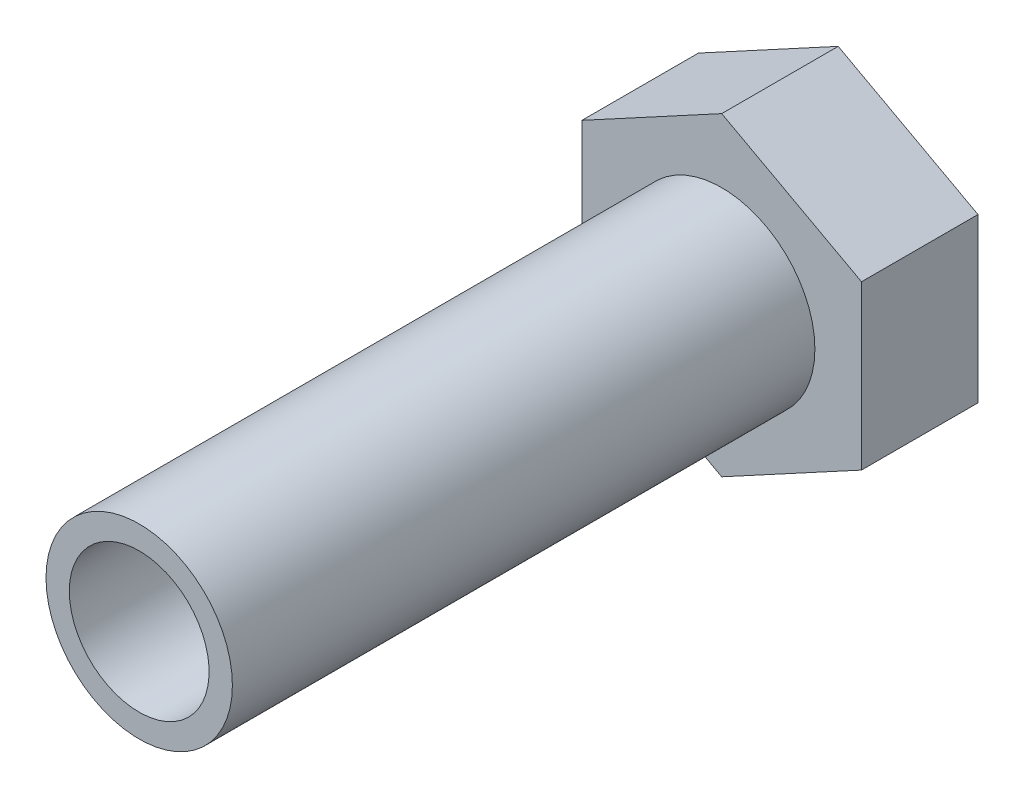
ISO-10303-21;
HEADER;
FILE_DESCRIPTION(('STEP AP214'),'2;1');
FILE_NAME('part.step','',(''),(''),'','','');
FILE_SCHEMA(('AUTOMOTIVE_DESIGN { 1 0 10303 214 1 1 1 1 }'));
ENDSEC;
DATA;
#1=APPLICATION_CONTEXT('core data for automotive mechanical design processes');
#2=APPLICATION_PROTOCOL_DEFINITION('international standard','automotive_design',2000,#1);
#3=PRODUCT_CONTEXT('',#1,'mechanical');
#4=PRODUCT('Part','Part','',(#3));
#5=PRODUCT_RELATED_PRODUCT_CATEGORY('part','',(#4));
#6=PRODUCT_DEFINITION_FORMATION('','',#4);
#7=PRODUCT_DEFINITION_CONTEXT('part definition',#1,'design');
#8=PRODUCT_DEFINITION('design','',#6,#7);
#9=PRODUCT_DEFINITION_SHAPE('','',#8);
#10=(LENGTH_UNIT() NAMED_UNIT(*) SI_UNIT(.MILLI.,.METRE.));
#11=(NAMED_UNIT(*) PLANE_ANGLE_UNIT() SI_UNIT($,.RADIAN.));
#12=(NAMED_UNIT(*) SI_UNIT($,.STERADIAN.) SOLID_ANGLE_UNIT());
#13=UNCERTAINTY_MEASURE_WITH_UNIT(LENGTH_MEASURE(1.E-05),#10,'distance_accuracy_value','');
#14=(GEOMETRIC_REPRESENTATION_CONTEXT(3) GLOBAL_UNCERTAINTY_ASSIGNED_CONTEXT((#13)) GLOBAL_UNIT_ASSIGNED_CONTEXT((#10,
#11,#12)) REPRESENTATION_CONTEXT('',''));
#15=CARTESIAN_POINT('',(0.,0.,0.));
#16=DIRECTION('',(0.,0.,1.));
#17=DIRECTION('',(1.,0.,0.));
#18=AXIS2_PLACEMENT_3D('',#15,#16,#17);
#19=CARTESIAN_POINT('',(-45.9682666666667,27.7426666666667,10.));
#20=DIRECTION('',(0.,0.,-1.));
#21=DIRECTION('',(-1.,0.,0.));
#22=AXIS2_PLACEMENT_3D('',#19,#20,#21);
#23=PLANE('',#22);
#24=DIRECTION('',(-0.879291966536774,0.476283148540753,0.));
#25=VECTOR('',#24,1.);
#26=CARTESIAN_POINT('',(-21.9682666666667,14.7426666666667,10.));
#27=LINE('',#26,#25);
#28=CARTESIAN_POINT('',(-21.9682666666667,14.7426666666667,10.));
#29=VERTEX_POINT('',#28);
#30=CARTESIAN_POINT('',(-33.9682666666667,21.2426666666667,10.));
#31=VERTEX_POINT('',#30);
#32=EDGE_CURVE('E128',#29,#31,#27,.T.);
#33=ORIENTED_EDGE('',*,*,#32,.T.);
#34=DIRECTION('',(-0.879291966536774,-0.476283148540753,0.));
#35=VECTOR('',#34,1.);
#36=CARTESIAN_POINT('',(-45.9682666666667,14.7426666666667,10.));
#37=LINE('',#36,#35);
#38=CARTESIAN_POINT('',(-45.9682666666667,14.7426666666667,10.));
#39=VERTEX_POINT('',#38);
#40=EDGE_CURVE('E86',#31,#39,#37,.T.);
#41=ORIENTED_EDGE('',*,*,#40,.T.);
#42=DIRECTION('',(0.,-1.,0.));
#43=VECTOR('',#42,1.);
#44=CARTESIAN_POINT('',(-45.9682666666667,0.742666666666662,10.));
#45=LINE('',#44,#43);
#46=CARTESIAN_POINT('',(-45.9682666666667,0.742666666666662,10.));
#47=VERTEX_POINT('',#46);
#48=EDGE_CURVE('E99',#39,#47,#45,.T.);
#49=ORIENTED_EDGE('',*,*,#48,.T.);
#50=DIRECTION('',(0.879291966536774,-0.476283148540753,0.));
#51=VECTOR('',#50,1.);
#52=CARTESIAN_POINT('',(-33.9682666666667,-5.75733333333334,10.));
#53=LINE('',#52,#51);
#54=CARTESIAN_POINT('',(-33.9682666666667,-5.75733333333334,10.));
#55=VERTEX_POINT('',#54);
#56=EDGE_CURVE('E93',#47,#55,#53,.T.);
#57=ORIENTED_EDGE('',*,*,#56,.T.);
#58=DIRECTION('',(0.879291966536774,0.476283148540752,0.));
#59=VECTOR('',#58,1.);
#60=CARTESIAN_POINT('',(-21.9682666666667,0.742666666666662,10.));
#61=LINE('',#60,#59);
#62=CARTESIAN_POINT('',(-21.9682666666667,0.742666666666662,10.));
#63=VERTEX_POINT('',#62);
#64=EDGE_CURVE('E97',#55,#63,#61,.T.);
#65=ORIENTED_EDGE('',*,*,#64,.T.);
#66=DIRECTION('',(0.,1.,0.));
#67=VECTOR('',#66,1.);
#68=CARTESIAN_POINT('',(-21.9682666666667,0.742666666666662,10.));
#69=LINE('',#68,#67);
#70=EDGE_CURVE('E48',#63,#29,#69,.T.);
#71=ORIENTED_EDGE('',*,*,#70,.T.);
#72=EDGE_LOOP('',(#33,#41,#49,#57,#65,#71));
#73=FACE_BOUND('',#72,.T.);
#74=CARTESIAN_POINT('',(-33.9682666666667,7.74266666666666,10.));
#75=DIRECTION('',(0.,0.,-1.));
#76=DIRECTION('',(-1.,0.,0.));
#77=AXIS2_PLACEMENT_3D('',#74,#75,#76);
#78=CIRCLE('',#77,8.);
#79=CARTESIAN_POINT('',(-41.9682666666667,7.74266666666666,10.));
#80=VERTEX_POINT('',#79);
#81=EDGE_CURVE('E11',#80,#80,#78,.F.);
#82=ORIENTED_EDGE('',*,*,#81,.F.);
#83=EDGE_LOOP('',(#82));
#84=FACE_BOUND('',#83,.T.);
#85=ADVANCED_FACE('F31',(#73,#84),#23,.F.);
#86=CARTESIAN_POINT('',(-21.9682666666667,14.7426666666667,10.));
#87=DIRECTION('',(-0.476283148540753,-0.879291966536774,0.));
#88=DIRECTION('',(0.879291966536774,-0.476283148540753,0.));
#89=AXIS2_PLACEMENT_3D('',#86,#87,#88);
#90=PLANE('',#89);
#91=DIRECTION('',(-0.879291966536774,0.476283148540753,0.));
#92=VECTOR('',#91,1.);
#93=CARTESIAN_POINT('',(-21.9682666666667,14.7426666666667,0.));
#94=LINE('',#93,#92);
#95=CARTESIAN_POINT('',(-21.9682666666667,14.7426666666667,0.));
#96=VERTEX_POINT('',#95);
#97=CARTESIAN_POINT('',(-33.9682666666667,21.2426666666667,0.));
#98=VERTEX_POINT('',#97);
#99=EDGE_CURVE('E117',#96,#98,#94,.T.);
#100=ORIENTED_EDGE('',*,*,#99,.T.);
#101=DIRECTION('',(0.,0.,-1.));
#102=VECTOR('',#101,1.);
#103=CARTESIAN_POINT('',(-33.9682666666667,21.2426666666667,10.));
#104=LINE('',#103,#102);
#105=EDGE_CURVE('E40',#31,#98,#104,.T.);
#106=ORIENTED_EDGE('',*,*,#105,.F.);
#107=ORIENTED_EDGE('',*,*,#32,.F.);
#108=DIRECTION('',(0.,0.,-1.));
#109=VECTOR('',#108,1.);
#110=CARTESIAN_POINT('',(-21.9682666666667,14.7426666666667,10.));
#111=LINE('',#110,#109);
#112=EDGE_CURVE('E113',#29,#96,#111,.T.);
#113=ORIENTED_EDGE('',*,*,#112,.T.);
#114=EDGE_LOOP('',(#100,#106,#107,#113));
#115=FACE_BOUND('',#114,.T.);
#116=ADVANCED_FACE('F33',(#115),#90,.F.);
#117=CARTESIAN_POINT('',(-45.9682666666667,14.7426666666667,10.));
#118=DIRECTION('',(0.476283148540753,-0.879291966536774,0.));
#119=DIRECTION('',(0.879291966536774,0.476283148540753,0.));
#120=AXIS2_PLACEMENT_3D('',#117,#118,#119);
#121=PLANE('',#120);
#122=DIRECTION('',(-0.879291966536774,-0.476283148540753,0.));
#123=VECTOR('',#122,1.);
#124=CARTESIAN_POINT('',(-45.9682666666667,14.7426666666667,0.));
#125=LINE('',#124,#123);
#126=CARTESIAN_POINT('',(-45.9682666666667,14.7426666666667,0.));
#127=VERTEX_POINT('',#126);
#128=EDGE_CURVE('E120',#98,#127,#125,.T.);
#129=ORIENTED_EDGE('',*,*,#128,.T.);
#130=DIRECTION('',(0.,0.,-1.));
#131=VECTOR('',#130,1.);
#132=CARTESIAN_POINT('',(-45.9682666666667,14.7426666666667,10.));
#133=LINE('',#132,#131);
#134=EDGE_CURVE('E132',#39,#127,#133,.T.);
#135=ORIENTED_EDGE('',*,*,#134,.F.);
#136=ORIENTED_EDGE('',*,*,#40,.F.);
#137=ORIENTED_EDGE('',*,*,#105,.T.);
#138=EDGE_LOOP('',(#129,#135,#136,#137));
#139=FACE_BOUND('',#138,.T.);
#140=ADVANCED_FACE('F135',(#139),#121,.F.);
#141=CARTESIAN_POINT('',(-45.9682666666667,0.742666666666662,10.));
#142=DIRECTION('',(1.,0.,0.));
#143=DIRECTION('',(0.,0.,-1.));
#144=AXIS2_PLACEMENT_3D('',#141,#142,#143);
#145=PLANE('',#144);
#146=DIRECTION('',(0.,-1.,0.));
#147=VECTOR('',#146,1.);
#148=CARTESIAN_POINT('',(-45.9682666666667,0.742666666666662,0.));
#149=LINE('',#148,#147);
#150=CARTESIAN_POINT('',(-45.9682666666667,0.742666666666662,0.));
#151=VERTEX_POINT('',#150);
#152=EDGE_CURVE('E123',#127,#151,#149,.T.);
#153=ORIENTED_EDGE('',*,*,#152,.T.);
#154=DIRECTION('',(0.,0.,-1.));
#155=VECTOR('',#154,1.);
#156=CARTESIAN_POINT('',(-45.9682666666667,0.742666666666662,10.));
#157=LINE('',#156,#155);
#158=EDGE_CURVE('E108',#47,#151,#157,.T.);
#159=ORIENTED_EDGE('',*,*,#158,.F.);
#160=ORIENTED_EDGE('',*,*,#48,.F.);
#161=ORIENTED_EDGE('',*,*,#134,.T.);
#162=EDGE_LOOP('',(#153,#159,#160,#161));
#163=FACE_BOUND('',#162,.T.);
#164=ADVANCED_FACE('F143',(#163),#145,.F.);
#165=CARTESIAN_POINT('',(-33.9682666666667,-5.75733333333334,10.));
#166=DIRECTION('',(0.476283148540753,0.879291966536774,0.));
#167=DIRECTION('',(-0.879291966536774,0.476283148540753,0.));
#168=AXIS2_PLACEMENT_3D('',#165,#166,#167);
#169=PLANE('',#168);
#170=DIRECTION('',(0.879291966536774,-0.476283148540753,0.));
#171=VECTOR('',#170,1.);
#172=CARTESIAN_POINT('',(-33.9682666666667,-5.75733333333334,0.));
#173=LINE('',#172,#171);
#174=CARTESIAN_POINT('',(-33.9682666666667,-5.75733333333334,0.));
#175=VERTEX_POINT('',#174);
#176=EDGE_CURVE('E107',#151,#175,#173,.T.);
#177=ORIENTED_EDGE('',*,*,#176,.T.);
#178=DIRECTION('',(0.,0.,-1.));
#179=VECTOR('',#178,1.);
#180=CARTESIAN_POINT('',(-33.9682666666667,-5.75733333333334,10.));
#181=LINE('',#180,#179);
#182=EDGE_CURVE('E104',#55,#175,#181,.T.);
#183=ORIENTED_EDGE('',*,*,#182,.F.);
#184=ORIENTED_EDGE('',*,*,#56,.F.);
#185=ORIENTED_EDGE('',*,*,#158,.T.);
#186=EDGE_LOOP('',(#177,#183,#184,#185));
#187=FACE_BOUND('',#186,.T.);
#188=ADVANCED_FACE('F105',(#187),#169,.F.);
#189=CARTESIAN_POINT('',(-21.9682666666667,0.742666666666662,10.));
#190=DIRECTION('',(-0.476283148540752,0.879291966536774,0.));
#191=DIRECTION('',(-0.879291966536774,-0.476283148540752,0.));
#192=AXIS2_PLACEMENT_3D('',#189,#190,#191);
#193=PLANE('',#192);
#194=DIRECTION('',(0.879291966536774,0.476283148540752,0.));
#195=VECTOR('',#194,1.);
#196=CARTESIAN_POINT('',(-21.9682666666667,0.742666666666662,0.));
#197=LINE('',#196,#195);
#198=CARTESIAN_POINT('',(-21.9682666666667,0.742666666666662,0.));
#199=VERTEX_POINT('',#198);
#200=EDGE_CURVE('E71',#175,#199,#197,.T.);
#201=ORIENTED_EDGE('',*,*,#200,.T.);
#202=DIRECTION('',(0.,0.,-1.));
#203=VECTOR('',#202,1.);
#204=CARTESIAN_POINT('',(-21.9682666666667,0.742666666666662,10.));
#205=LINE('',#204,#203);
#206=EDGE_CURVE('E109',#63,#199,#205,.T.);
#207=ORIENTED_EDGE('',*,*,#206,.F.);
#208=ORIENTED_EDGE('',*,*,#64,.F.);
#209=ORIENTED_EDGE('',*,*,#182,.T.);
#210=EDGE_LOOP('',(#201,#207,#208,#209));
#211=FACE_BOUND('',#210,.T.);
#212=ADVANCED_FACE('F111',(#211),#193,.F.);
#213=CARTESIAN_POINT('',(-21.9682666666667,0.742666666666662,10.));
#214=DIRECTION('',(-1.,0.,0.));
#215=DIRECTION('',(0.,0.,1.));
#216=AXIS2_PLACEMENT_3D('',#213,#214,#215);
#217=PLANE('',#216);
#218=DIRECTION('',(0.,1.,0.));
#219=VECTOR('',#218,1.);
#220=CARTESIAN_POINT('',(-21.9682666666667,0.742666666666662,0.));
#221=LINE('',#220,#219);
#222=EDGE_CURVE('E77',#199,#96,#221,.T.);
#223=ORIENTED_EDGE('',*,*,#222,.T.);
#224=ORIENTED_EDGE('',*,*,#112,.F.);
#225=ORIENTED_EDGE('',*,*,#70,.F.);
#226=ORIENTED_EDGE('',*,*,#206,.T.);
#227=EDGE_LOOP('',(#223,#224,#225,#226));
#228=FACE_BOUND('',#227,.T.);
#229=ADVANCED_FACE('F167',(#228),#217,.F.);
#230=CARTESIAN_POINT('',(-45.9682666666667,27.7426666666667,0.));
#231=DIRECTION('',(0.,0.,-1.));
#232=DIRECTION('',(-1.,0.,0.));
#233=AXIS2_PLACEMENT_3D('',#230,#231,#232);
#234=PLANE('',#233);
#235=CARTESIAN_POINT('',(-33.9682666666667,7.74266666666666,0.));
#236=DIRECTION('',(0.,0.,-1.));
#237=DIRECTION('',(-1.,0.,0.));
#238=AXIS2_PLACEMENT_3D('',#235,#236,#237);
#239=CIRCLE('',#238,5.99999999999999);
#240=CARTESIAN_POINT('',(-39.9682666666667,7.74266666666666,0.));
#241=VERTEX_POINT('',#240);
#242=EDGE_CURVE('E150',#241,#241,#239,.T.);
#243=ORIENTED_EDGE('',*,*,#242,.F.);
#244=EDGE_LOOP('',(#243));
#245=FACE_BOUND('',#244,.T.);
#246=ORIENTED_EDGE('',*,*,#99,.F.);
#247=ORIENTED_EDGE('',*,*,#222,.F.);
#248=ORIENTED_EDGE('',*,*,#200,.F.);
#249=ORIENTED_EDGE('',*,*,#176,.F.);
#250=ORIENTED_EDGE('',*,*,#152,.F.);
#251=ORIENTED_EDGE('',*,*,#128,.F.);
#252=EDGE_LOOP('',(#246,#247,#248,#249,#250,#251));
#253=FACE_BOUND('',#252,.T.);
#254=ADVANCED_FACE('F140',(#245,#253),#234,.T.);
#255=CARTESIAN_POINT('',(-33.9682666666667,7.74266666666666,60.));
#256=DIRECTION('',(0.,0.,-1.));
#257=DIRECTION('',(-1.,0.,0.));
#258=AXIS2_PLACEMENT_3D('',#255,#256,#257);
#259=CYLINDRICAL_SURFACE('',#258,8.);
#260=CARTESIAN_POINT('',(-33.9682666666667,7.74266666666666,60.));
#261=DIRECTION('',(0.,0.,1.));
#262=DIRECTION('',(1.,0.,0.));
#263=AXIS2_PLACEMENT_3D('',#260,#261,#262);
#264=CIRCLE('',#263,8.);
#265=CARTESIAN_POINT('',(-25.9682666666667,7.74266666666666,60.));
#266=VERTEX_POINT('',#265);
#267=EDGE_CURVE('E121',#266,#266,#264,.T.);
#268=ORIENTED_EDGE('',*,*,#267,.F.);
#269=EDGE_LOOP('',(#268));
#270=FACE_BOUND('',#269,.T.);
#271=ORIENTED_EDGE('',*,*,#81,.T.);
#272=EDGE_LOOP('',(#271));
#273=FACE_BOUND('',#272,.T.);
#274=ADVANCED_FACE('F166',(#270,#273),#259,.T.);
#275=CARTESIAN_POINT('',(-33.9682666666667,7.74266666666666,60.));
#276=DIRECTION('',(0.,0.,1.));
#277=DIRECTION('',(1.,0.,0.));
#278=AXIS2_PLACEMENT_3D('',#275,#276,#277);
#279=PLANE('',#278);
#280=CARTESIAN_POINT('',(-33.9682666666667,7.74266666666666,60.));
#281=DIRECTION('',(0.,0.,-1.));
#282=DIRECTION('',(-1.,0.,0.));
#283=AXIS2_PLACEMENT_3D('',#280,#281,#282);
#284=CIRCLE('',#283,5.99999999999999);
#285=CARTESIAN_POINT('',(-39.9682666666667,7.74266666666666,60.));
#286=VERTEX_POINT('',#285);
#287=EDGE_CURVE('E149',#286,#286,#284,.T.);
#288=ORIENTED_EDGE('',*,*,#287,.T.);
#289=EDGE_LOOP('',(#288));
#290=FACE_BOUND('',#289,.T.);
#291=ORIENTED_EDGE('',*,*,#267,.T.);
#292=EDGE_LOOP('',(#291));
#293=FACE_BOUND('',#292,.T.);
#294=ADVANCED_FACE('F156',(#290,#293),#279,.T.);
#295=CARTESIAN_POINT('',(-33.9682666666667,7.74266666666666,60.));
#296=DIRECTION('',(0.,0.,-1.));
#297=DIRECTION('',(-1.,0.,0.));
#298=AXIS2_PLACEMENT_3D('',#295,#296,#297);
#299=CYLINDRICAL_SURFACE('',#298,5.99999999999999);
#300=CARTESIAN_POINT('',(-39.9682666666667,7.74266666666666,60.));
#301=CARTESIAN_POINT('',(-39.9682666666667,7.74266666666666,59.375));
#302=CARTESIAN_POINT('',(-39.9682666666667,7.74266666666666,58.75));
#303=CARTESIAN_POINT('',(-39.9682666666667,7.74266666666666,57.5));
#304=CARTESIAN_POINT('',(-39.9682666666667,7.74266666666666,56.875));
#305=CARTESIAN_POINT('',(-39.9682666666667,7.74266666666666,55.625));
#306=CARTESIAN_POINT('',(-39.9682666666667,7.74266666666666,55.));
#307=CARTESIAN_POINT('',(-39.9682666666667,7.74266666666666,53.75));
#308=CARTESIAN_POINT('',(-39.9682666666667,7.74266666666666,53.125));
#309=CARTESIAN_POINT('',(-39.9682666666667,7.74266666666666,51.875));
#310=CARTESIAN_POINT('',(-39.9682666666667,7.74266666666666,51.25));
#311=CARTESIAN_POINT('',(-39.9682666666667,7.74266666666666,50.));
#312=CARTESIAN_POINT('',(-39.9682666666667,7.74266666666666,49.375));
#313=CARTESIAN_POINT('',(-39.9682666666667,7.74266666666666,48.125));
#314=CARTESIAN_POINT('',(-39.9682666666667,7.74266666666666,47.5));
#315=CARTESIAN_POINT('',(-39.9682666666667,7.74266666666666,46.25));
#316=CARTESIAN_POINT('',(-39.9682666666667,7.74266666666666,45.625));
#317=CARTESIAN_POINT('',(-39.9682666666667,7.74266666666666,44.375));
#318=CARTESIAN_POINT('',(-39.9682666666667,7.74266666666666,43.75));
#319=CARTESIAN_POINT('',(-39.9682666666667,7.74266666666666,42.5));
#320=CARTESIAN_POINT('',(-39.9682666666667,7.74266666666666,41.875));
#321=CARTESIAN_POINT('',(-39.9682666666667,7.74266666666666,40.625));
#322=CARTESIAN_POINT('',(-39.9682666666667,7.74266666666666,40.));
#323=CARTESIAN_POINT('',(-39.9682666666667,7.74266666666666,38.75));
#324=CARTESIAN_POINT('',(-39.9682666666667,7.74266666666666,38.125));
#325=CARTESIAN_POINT('',(-39.9682666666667,7.74266666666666,36.875));
#326=CARTESIAN_POINT('',(-39.9682666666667,7.74266666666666,36.25));
#327=CARTESIAN_POINT('',(-39.9682666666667,7.74266666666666,35.));
#328=CARTESIAN_POINT('',(-39.9682666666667,7.74266666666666,34.375));
#329=CARTESIAN_POINT('',(-39.9682666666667,7.74266666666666,33.125));
#330=CARTESIAN_POINT('',(-39.9682666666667,7.74266666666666,32.5));
#331=CARTESIAN_POINT('',(-39.9682666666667,7.74266666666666,31.25));
#332=CARTESIAN_POINT('',(-39.9682666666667,7.74266666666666,30.625));
#333=CARTESIAN_POINT('',(-39.9682666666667,7.74266666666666,29.375));
#334=CARTESIAN_POINT('',(-39.9682666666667,7.74266666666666,28.75));
#335=CARTESIAN_POINT('',(-39.9682666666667,7.74266666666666,27.5));
#336=CARTESIAN_POINT('',(-39.9682666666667,7.74266666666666,26.875));
#337=CARTESIAN_POINT('',(-39.9682666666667,7.74266666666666,25.625));
#338=CARTESIAN_POINT('',(-39.9682666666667,7.74266666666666,25.));
#339=CARTESIAN_POINT('',(-39.9682666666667,7.74266666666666,23.75));
#340=CARTESIAN_POINT('',(-39.9682666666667,7.74266666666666,23.125));
#341=CARTESIAN_POINT('',(-39.9682666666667,7.74266666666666,21.875));
#342=CARTESIAN_POINT('',(-39.9682666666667,7.74266666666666,21.25));
#343=CARTESIAN_POINT('',(-39.9682666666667,7.74266666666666,20.));
#344=CARTESIAN_POINT('',(-39.9682666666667,7.74266666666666,19.375));
#345=CARTESIAN_POINT('',(-39.9682666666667,7.74266666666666,18.125));
#346=CARTESIAN_POINT('',(-39.9682666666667,7.74266666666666,17.5));
#347=CARTESIAN_POINT('',(-39.9682666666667,7.74266666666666,16.25));
#348=CARTESIAN_POINT('',(-39.9682666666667,7.74266666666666,15.625));
#349=CARTESIAN_POINT('',(-39.9682666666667,7.74266666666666,14.375));
#350=CARTESIAN_POINT('',(-39.9682666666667,7.74266666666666,13.75));
#351=CARTESIAN_POINT('',(-39.9682666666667,7.74266666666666,12.5));
#352=CARTESIAN_POINT('',(-39.9682666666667,7.74266666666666,11.875));
#353=CARTESIAN_POINT('',(-39.9682666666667,7.74266666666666,10.625));
#354=CARTESIAN_POINT('',(-39.9682666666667,7.74266666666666,10.));
#355=CARTESIAN_POINT('',(-39.9682666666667,7.74266666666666,8.75));
#356=CARTESIAN_POINT('',(-39.9682666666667,7.74266666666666,8.125));
#357=CARTESIAN_POINT('',(-39.9682666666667,7.74266666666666,6.875));
#358=CARTESIAN_POINT('',(-39.9682666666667,7.74266666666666,6.25));
#359=CARTESIAN_POINT('',(-39.9682666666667,7.74266666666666,5.));
#360=CARTESIAN_POINT('',(-39.9682666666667,7.74266666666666,4.375));
#361=CARTESIAN_POINT('',(-39.9682666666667,7.74266666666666,3.125));
#362=CARTESIAN_POINT('',(-39.9682666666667,7.74266666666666,2.5));
#363=CARTESIAN_POINT('',(-39.9682666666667,7.74266666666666,1.25));
#364=CARTESIAN_POINT('',(-39.9682666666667,7.74266666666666,0.625000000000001));
#365=CARTESIAN_POINT('',(-39.9682666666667,7.74266666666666,0.));
#366=B_SPLINE_CURVE_WITH_KNOTS('',3,(#300,#301,#302,#303,#304,#305,#306,#307,#308,#309,#310,
#311,#312,#313,#314,#315,#316,#317,#318,#319,#320,#321,#322,#323,#324,#325,#326,#327,#328,#329,
#330,#331,#332,#333,#334,#335,#336,#337,#338,#339,#340,#341,#342,#343,#344,#345,#346,#347,#348,
#349,#350,#351,#352,#353,#354,#355,#356,#357,#358,#359,#360,#361,#362,#363,#364,#365),
.UNSPECIFIED.,.F.,.F.,(4,2,2,2,2,2,2,2,2,2,2,2,2,2,2,2,2,2,2,2,2,2,2,2,2,2,2,2,2,2,2,2,4),(0.,
1.875,3.75,5.62500000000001,7.50000000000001,9.37500000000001,11.25,13.125,15.,16.875,18.75,
20.625,22.5,24.375,26.25,28.125,30.,31.875,33.75,35.625,37.5,39.375,41.25,43.125,45.,46.875,
48.75,50.625,52.5,54.375,56.25,58.125,60.),.UNSPECIFIED.);
#367=EDGE_CURVE('BSEAM159',#286,#241,#366,.T.);
#368=ORIENTED_EDGE('',*,*,#287,.F.);
#369=ORIENTED_EDGE('',*,*,#242,.T.);
#370=ORIENTED_EDGE('',*,*,#367,.T.);
#371=ORIENTED_EDGE('',*,*,#367,.F.);
#372=EDGE_LOOP('',(#368,#370,#369,#371));
#373=FACE_BOUND('',#372,.T.);
#374=ADVANCED_FACE('F159',(#373),#299,.F.);
#375=CLOSED_SHELL('',(#85,#116,#140,#164,#188,#212,#229,#254,#274,#294,#374));
#376=MANIFOLD_SOLID_BREP('B2',#375);
#377=ADVANCED_BREP_SHAPE_REPRESENTATION('',(#18,#376),#14);
#378=SHAPE_DEFINITION_REPRESENTATION(#9,#377);
ENDSEC;
END-ISO-10303-21;
